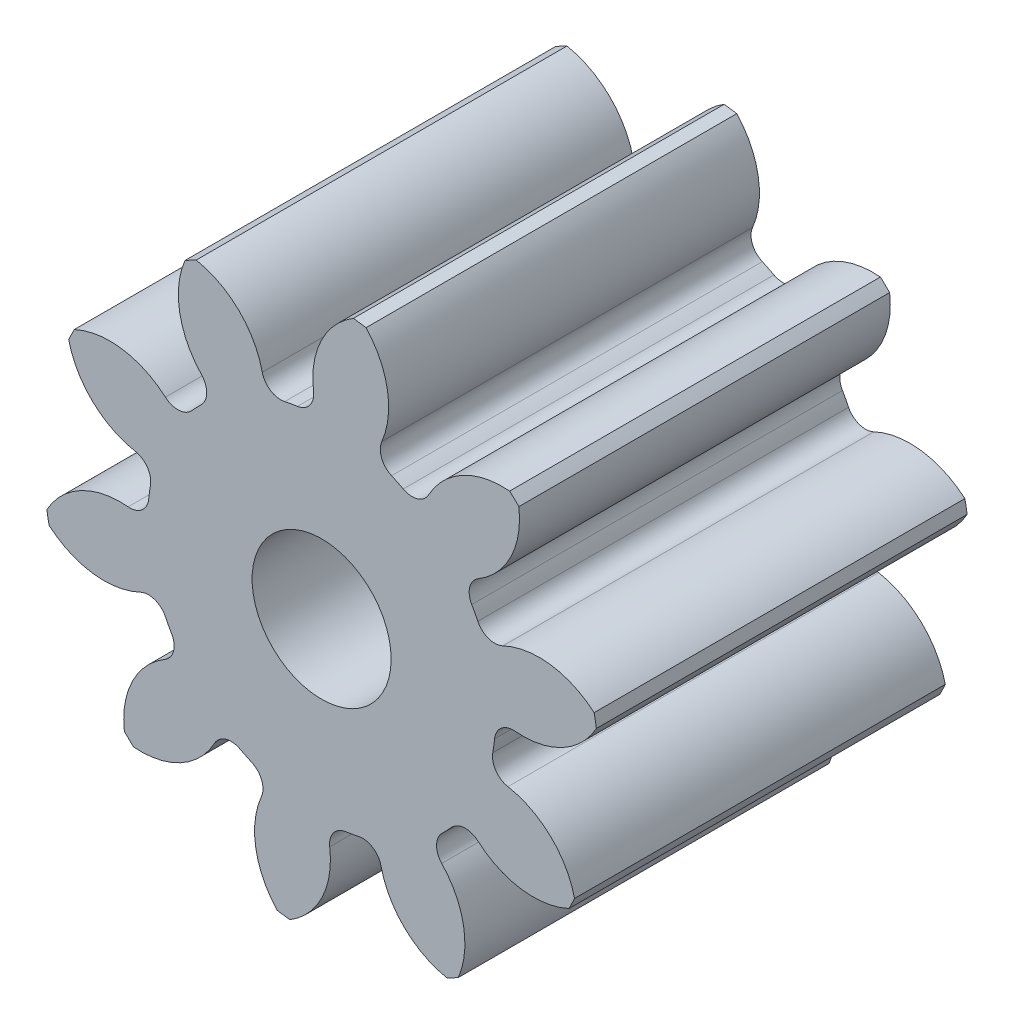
from build123d import *

# Parameters (mm, degrees)
SKETCH3_R         = 76.2
GEARBODY_DEPTH    = 101.6
TOOTHCUT_DEPTH    = 149.106178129
CIRPATTERN1_COUNT = 10
BOREDIA_R         = 19.05
BORE_DEPTH        = 12700


with BuildPart() as part:
    # Sketch3 → gearBody (new body)
    with BuildSketch(Plane.XY):
        Circle(SKETCH3_R)
    extrude(amount=GEARBODY_DEPTH)

    # Sketch2 → toothCut (cut, through all)
    with BuildSketch(Plane.XY):
        with BuildLine():
            ThreePointArc((46.899947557, -8.278619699), (47.176606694, -6.519847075), (47.387334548, -4.751962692))
            ThreePointArc((47.387334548, -4.751962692), (49.242894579, -1.279028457), (53.006241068, -0.120754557))
            ThreePointArc((53.006241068, -0.120754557), (66.791947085, 2.949589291), (76.2, 13.483403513))
            ThreePointArc((76.2, 13.483403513), (76.655159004, -10.593808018), (69.686803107, -33.64508349))
            ThreePointArc((69.686803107, -33.64508349), (63.488389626, -20.954442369), (51.052157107, -14.260204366))
            ThreePointArc((51.052157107, -14.260204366), (47.74402109, -12.124645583), (46.899947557, -8.278619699))
        make_face()
    toothcut = extrude(amount=TOOTHCUT_DEPTH, mode=Mode.SUBTRACT)

    # CirPattern1: toothCut ×10 about axis
    cirpattern1_axis = Axis((0, 0, 0), (0, 0, 1))
    for i in range(1, CIRPATTERN1_COUNT):
        add(toothcut.rotate(cirpattern1_axis, i * 360 / CIRPATTERN1_COUNT), mode=Mode.SUBTRACT)

    # boreDia → bore (cut, symmetric)
    with BuildSketch(Plane.XY):
        Circle(BOREDIA_R)
    extrude(amount=BORE_DEPTH, both=True, mode=Mode.SUBTRACT)


solid = part.part
